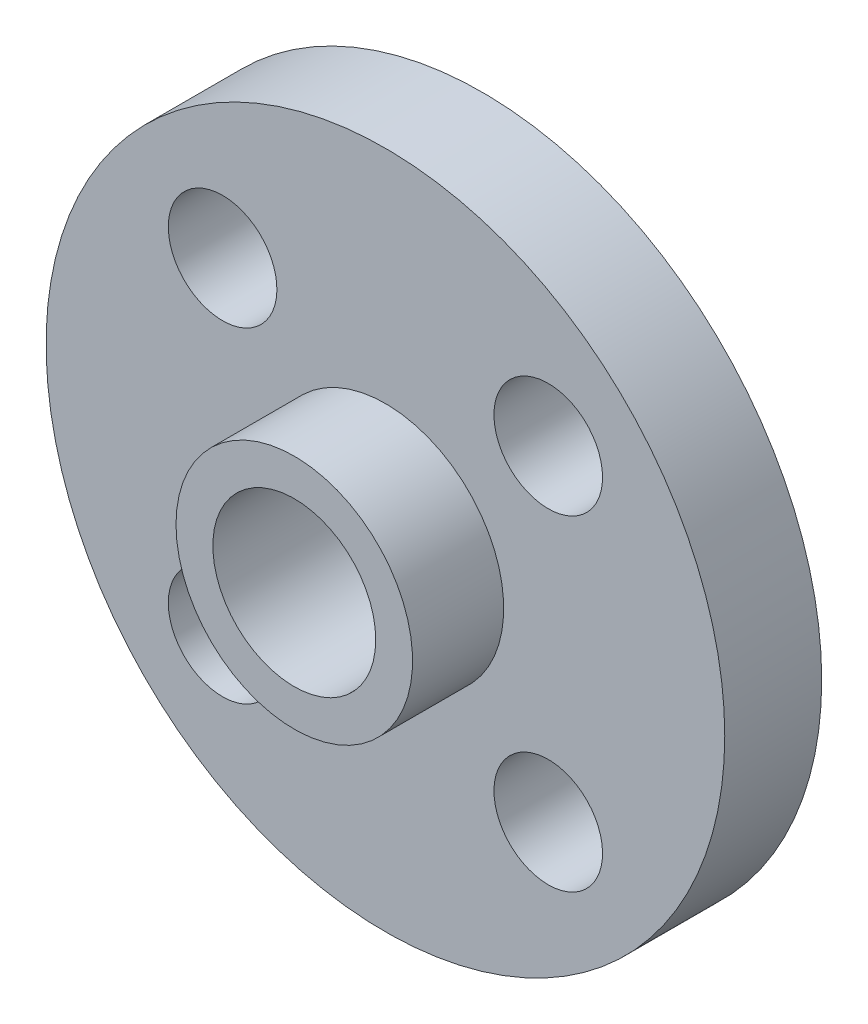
ISO-10303-21;
HEADER;
FILE_DESCRIPTION(('STEP AP214'),'2;1');
FILE_NAME('part.step','',(''),(''),'','','');
FILE_SCHEMA(('AUTOMOTIVE_DESIGN { 1 0 10303 214 1 1 1 1 }'));
ENDSEC;
DATA;
#1=APPLICATION_CONTEXT('core data for automotive mechanical design processes');
#2=APPLICATION_PROTOCOL_DEFINITION('international standard','automotive_design',2000,#1);
#3=PRODUCT_CONTEXT('',#1,'mechanical');
#4=PRODUCT('Part','Part','',(#3));
#5=PRODUCT_RELATED_PRODUCT_CATEGORY('part','',(#4));
#6=PRODUCT_DEFINITION_FORMATION('','',#4);
#7=PRODUCT_DEFINITION_CONTEXT('part definition',#1,'design');
#8=PRODUCT_DEFINITION('design','',#6,#7);
#9=PRODUCT_DEFINITION_SHAPE('','',#8);
#10=(LENGTH_UNIT() NAMED_UNIT(*) SI_UNIT(.MILLI.,.METRE.));
#11=(NAMED_UNIT(*) PLANE_ANGLE_UNIT() SI_UNIT($,.RADIAN.));
#12=(NAMED_UNIT(*) SI_UNIT($,.STERADIAN.) SOLID_ANGLE_UNIT());
#13=UNCERTAINTY_MEASURE_WITH_UNIT(LENGTH_MEASURE(1.E-05),#10,'distance_accuracy_value','');
#14=(GEOMETRIC_REPRESENTATION_CONTEXT(3) GLOBAL_UNCERTAINTY_ASSIGNED_CONTEXT((#13)) GLOBAL_UNIT_ASSIGNED_CONTEXT((#10,
#11,#12)) REPRESENTATION_CONTEXT('',''));
#15=CARTESIAN_POINT('',(0.,0.,0.));
#16=DIRECTION('',(0.,0.,1.));
#17=DIRECTION('',(1.,0.,0.));
#18=AXIS2_PLACEMENT_3D('',#15,#16,#17);
#19=CARTESIAN_POINT('',(0.,0.,0.));
#20=DIRECTION('',(0.,0.,1.));
#21=DIRECTION('',(1.,0.,0.));
#22=AXIS2_PLACEMENT_3D('',#19,#20,#21);
#23=PLANE('',#22);
#24=CARTESIAN_POINT('',(0.,0.,0.));
#25=DIRECTION('',(0.,0.,1.));
#26=DIRECTION('',(1.,0.,0.));
#27=AXIS2_PLACEMENT_3D('',#24,#25,#26);
#28=CIRCLE('',#27,44.45);
#29=CARTESIAN_POINT('',(44.45,0.,0.));
#30=VERTEX_POINT('',#29);
#31=EDGE_CURVE('E46',#30,#30,#28,.T.);
#32=ORIENTED_EDGE('',*,*,#31,.F.);
#33=EDGE_LOOP('',(#32));
#34=FACE_BOUND('',#33,.T.);
#35=CARTESIAN_POINT('',(21.3281082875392,21.3281082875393,0.));
#36=DIRECTION('',(0.,0.,1.));
#37=DIRECTION('',(1.,0.,0.));
#38=AXIS2_PLACEMENT_3D('',#35,#36,#37);
#39=CIRCLE('',#38,7.112);
#40=CARTESIAN_POINT('',(28.4401082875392,21.3281082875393,0.));
#41=VERTEX_POINT('',#40);
#42=EDGE_CURVE('E55',#41,#41,#39,.T.);
#43=ORIENTED_EDGE('',*,*,#42,.T.);
#44=EDGE_LOOP('',(#43));
#45=FACE_BOUND('',#44,.T.);
#46=CARTESIAN_POINT('',(21.3281082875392,-21.3281082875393,0.));
#47=DIRECTION('',(0.,0.,1.));
#48=DIRECTION('',(0.,-1.,0.));
#49=AXIS2_PLACEMENT_3D('',#46,#47,#48);
#50=CIRCLE('',#49,7.112);
#51=CARTESIAN_POINT('',(21.3281082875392,-28.4401082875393,0.));
#52=VERTEX_POINT('',#51);
#53=EDGE_CURVE('E68',#52,#52,#50,.T.);
#54=ORIENTED_EDGE('',*,*,#53,.T.);
#55=EDGE_LOOP('',(#54));
#56=FACE_BOUND('',#55,.T.);
#57=CARTESIAN_POINT('',(-21.3281082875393,-21.3281082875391,0.));
#58=DIRECTION('',(0.,0.,1.));
#59=DIRECTION('',(-1.,0.,0.));
#60=AXIS2_PLACEMENT_3D('',#57,#58,#59);
#61=CIRCLE('',#60,7.112);
#62=CARTESIAN_POINT('',(-28.4401082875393,-21.3281082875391,0.));
#63=VERTEX_POINT('',#62);
#64=EDGE_CURVE('E74',#63,#63,#61,.T.);
#65=ORIENTED_EDGE('',*,*,#64,.T.);
#66=EDGE_LOOP('',(#65));
#67=FACE_BOUND('',#66,.T.);
#68=CARTESIAN_POINT('',(-21.3281082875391,21.3281082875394,0.));
#69=DIRECTION('',(0.,0.,1.));
#70=DIRECTION('',(0.,1.,0.));
#71=AXIS2_PLACEMENT_3D('',#68,#69,#70);
#72=CIRCLE('',#71,7.112);
#73=CARTESIAN_POINT('',(-21.328108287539,28.4401082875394,0.));
#74=VERTEX_POINT('',#73);
#75=EDGE_CURVE('E80',#74,#74,#72,.T.);
#76=ORIENTED_EDGE('',*,*,#75,.T.);
#77=EDGE_LOOP('',(#76));
#78=FACE_BOUND('',#77,.T.);
#79=CARTESIAN_POINT('',(0.,0.,0.));
#80=DIRECTION('',(0.,0.,1.));
#81=DIRECTION('',(1.,0.,0.));
#82=AXIS2_PLACEMENT_3D('',#79,#80,#81);
#83=CIRCLE('',#82,18.034);
#84=CARTESIAN_POINT('',(18.034,0.,0.));
#85=VERTEX_POINT('',#84);
#86=EDGE_CURVE('E10',#85,#85,#83,.F.);
#87=ORIENTED_EDGE('',*,*,#86,.F.);
#88=EDGE_LOOP('',(#87));
#89=FACE_BOUND('',#88,.T.);
#90=ADVANCED_FACE('F30',(#34,#45,#56,#67,#78,#89),#23,.F.);
#91=CARTESIAN_POINT('',(0.,0.,12.7));
#92=DIRECTION('',(0.,0.,-1.));
#93=DIRECTION('',(-1.,0.,0.));
#94=AXIS2_PLACEMENT_3D('',#91,#92,#93);
#95=CYLINDRICAL_SURFACE('',#94,44.45);
#96=CARTESIAN_POINT('',(0.,0.,12.7));
#97=DIRECTION('',(0.,0.,1.));
#98=DIRECTION('',(1.,0.,0.));
#99=AXIS2_PLACEMENT_3D('',#96,#97,#98);
#100=CIRCLE('',#99,44.45);
#101=CARTESIAN_POINT('',(44.45,0.,12.7));
#102=VERTEX_POINT('',#101);
#103=EDGE_CURVE('E41',#102,#102,#100,.T.);
#104=ORIENTED_EDGE('',*,*,#103,.F.);
#105=EDGE_LOOP('',(#104));
#106=FACE_BOUND('',#105,.T.);
#107=ORIENTED_EDGE('',*,*,#31,.T.);
#108=EDGE_LOOP('',(#107));
#109=FACE_BOUND('',#108,.T.);
#110=ADVANCED_FACE('F32',(#106,#109),#95,.T.);
#111=CARTESIAN_POINT('',(0.,0.,12.7));
#112=DIRECTION('',(0.,0.,1.));
#113=DIRECTION('',(1.,0.,0.));
#114=AXIS2_PLACEMENT_3D('',#111,#112,#113);
#115=PLANE('',#114);
#116=CARTESIAN_POINT('',(-21.3281082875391,21.3281082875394,12.7));
#117=DIRECTION('',(0.,0.,1.));
#118=DIRECTION('',(0.,1.,0.));
#119=AXIS2_PLACEMENT_3D('',#116,#117,#118);
#120=CIRCLE('',#119,7.112);
#121=CARTESIAN_POINT('',(-21.328108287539,28.4401082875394,12.7));
#122=VERTEX_POINT('',#121);
#123=EDGE_CURVE('E77',#122,#122,#120,.T.);
#124=ORIENTED_EDGE('',*,*,#123,.F.);
#125=EDGE_LOOP('',(#124));
#126=FACE_BOUND('',#125,.T.);
#127=CARTESIAN_POINT('',(-21.3281082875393,-21.3281082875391,12.7));
#128=DIRECTION('',(0.,0.,1.));
#129=DIRECTION('',(-1.,0.,0.));
#130=AXIS2_PLACEMENT_3D('',#127,#128,#129);
#131=CIRCLE('',#130,7.112);
#132=CARTESIAN_POINT('',(-28.4401082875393,-21.3281082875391,12.7));
#133=VERTEX_POINT('',#132);
#134=EDGE_CURVE('E71',#133,#133,#131,.T.);
#135=ORIENTED_EDGE('',*,*,#134,.F.);
#136=EDGE_LOOP('',(#135));
#137=FACE_BOUND('',#136,.T.);
#138=CARTESIAN_POINT('',(21.3281082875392,-21.3281082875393,12.7));
#139=DIRECTION('',(0.,0.,1.));
#140=DIRECTION('',(0.,-1.,0.));
#141=AXIS2_PLACEMENT_3D('',#138,#139,#140);
#142=CIRCLE('',#141,7.112);
#143=CARTESIAN_POINT('',(21.3281082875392,-28.4401082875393,12.7));
#144=VERTEX_POINT('',#143);
#145=EDGE_CURVE('E64',#144,#144,#142,.T.);
#146=ORIENTED_EDGE('',*,*,#145,.F.);
#147=EDGE_LOOP('',(#146));
#148=FACE_BOUND('',#147,.T.);
#149=CARTESIAN_POINT('',(21.3281082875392,21.3281082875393,12.7));
#150=DIRECTION('',(0.,0.,1.));
#151=DIRECTION('',(1.,0.,0.));
#152=AXIS2_PLACEMENT_3D('',#149,#150,#151);
#153=CIRCLE('',#152,7.112);
#154=CARTESIAN_POINT('',(28.4401082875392,21.3281082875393,12.7));
#155=VERTEX_POINT('',#154);
#156=EDGE_CURVE('E59',#155,#155,#153,.T.);
#157=ORIENTED_EDGE('',*,*,#156,.F.);
#158=EDGE_LOOP('',(#157));
#159=FACE_BOUND('',#158,.T.);
#160=CARTESIAN_POINT('',(0.,0.,12.7));
#161=DIRECTION('',(0.,0.,1.));
#162=DIRECTION('',(1.,0.,0.));
#163=AXIS2_PLACEMENT_3D('',#160,#161,#162);
#164=CIRCLE('',#163,15.494);
#165=CARTESIAN_POINT('',(-15.494,0.,12.7));
#166=VERTEX_POINT('',#165);
#167=EDGE_CURVE('E37',#166,#166,#164,.T.);
#168=ORIENTED_EDGE('',*,*,#167,.F.);
#169=EDGE_LOOP('',(#168));
#170=FACE_BOUND('',#169,.T.);
#171=ORIENTED_EDGE('',*,*,#103,.T.);
#172=EDGE_LOOP('',(#171));
#173=FACE_BOUND('',#172,.T.);
#174=ADVANCED_FACE('F123',(#126,#137,#148,#159,#170,#173),#115,.T.);
#175=CARTESIAN_POINT('',(0.,0.,24.638));
#176=DIRECTION('',(0.,0.,-1.));
#177=DIRECTION('',(-1.,0.,0.));
#178=AXIS2_PLACEMENT_3D('',#175,#176,#177);
#179=CYLINDRICAL_SURFACE('',#178,15.494);
#180=CARTESIAN_POINT('',(0.,0.,24.638));
#181=DIRECTION('',(0.,0.,-1.));
#182=DIRECTION('',(-1.,0.,0.));
#183=AXIS2_PLACEMENT_3D('',#180,#181,#182);
#184=CIRCLE('',#183,15.494);
#185=CARTESIAN_POINT('',(-15.494,0.,24.638));
#186=VERTEX_POINT('',#185);
#187=EDGE_CURVE('E49',#186,#186,#184,.T.);
#188=CARTESIAN_POINT('',(-15.494,0.,12.7));
#189=CARTESIAN_POINT('',(-15.494,0.,12.8243541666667));
#190=CARTESIAN_POINT('',(-15.494,0.,12.9487083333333));
#191=CARTESIAN_POINT('',(-15.494,0.,13.1974166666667));
#192=CARTESIAN_POINT('',(-15.494,0.,13.3217708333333));
#193=CARTESIAN_POINT('',(-15.494,0.,13.5704791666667));
#194=CARTESIAN_POINT('',(-15.494,0.,13.6948333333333));
#195=CARTESIAN_POINT('',(-15.494,0.,13.9435416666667));
#196=CARTESIAN_POINT('',(-15.494,0.,14.0678958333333));
#197=CARTESIAN_POINT('',(-15.494,0.,14.3166041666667));
#198=CARTESIAN_POINT('',(-15.494,0.,14.4409583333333));
#199=CARTESIAN_POINT('',(-15.494,0.,14.6896666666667));
#200=CARTESIAN_POINT('',(-15.494,0.,14.8140208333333));
#201=CARTESIAN_POINT('',(-15.494,0.,15.0627291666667));
#202=CARTESIAN_POINT('',(-15.494,0.,15.1870833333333));
#203=CARTESIAN_POINT('',(-15.494,0.,15.4357916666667));
#204=CARTESIAN_POINT('',(-15.494,0.,15.5601458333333));
#205=CARTESIAN_POINT('',(-15.494,0.,15.8088541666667));
#206=CARTESIAN_POINT('',(-15.494,0.,15.9332083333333));
#207=CARTESIAN_POINT('',(-15.494,0.,16.1819166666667));
#208=CARTESIAN_POINT('',(-15.494,0.,16.3062708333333));
#209=CARTESIAN_POINT('',(-15.494,0.,16.5549791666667));
#210=CARTESIAN_POINT('',(-15.494,0.,16.6793333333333));
#211=CARTESIAN_POINT('',(-15.494,0.,16.9280416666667));
#212=CARTESIAN_POINT('',(-15.494,0.,17.0523958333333));
#213=CARTESIAN_POINT('',(-15.494,0.,17.3011041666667));
#214=CARTESIAN_POINT('',(-15.494,0.,17.4254583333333));
#215=CARTESIAN_POINT('',(-15.494,0.,17.6741666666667));
#216=CARTESIAN_POINT('',(-15.494,0.,17.7985208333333));
#217=CARTESIAN_POINT('',(-15.494,0.,18.0472291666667));
#218=CARTESIAN_POINT('',(-15.494,0.,18.1715833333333));
#219=CARTESIAN_POINT('',(-15.494,0.,18.4202916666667));
#220=CARTESIAN_POINT('',(-15.494,0.,18.5446458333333));
#221=CARTESIAN_POINT('',(-15.494,0.,18.7933541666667));
#222=CARTESIAN_POINT('',(-15.494,0.,18.9177083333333));
#223=CARTESIAN_POINT('',(-15.494,0.,19.1664166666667));
#224=CARTESIAN_POINT('',(-15.494,0.,19.2907708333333));
#225=CARTESIAN_POINT('',(-15.494,0.,19.5394791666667));
#226=CARTESIAN_POINT('',(-15.494,0.,19.6638333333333));
#227=CARTESIAN_POINT('',(-15.494,0.,19.9125416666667));
#228=CARTESIAN_POINT('',(-15.494,0.,20.0368958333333));
#229=CARTESIAN_POINT('',(-15.494,0.,20.2856041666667));
#230=CARTESIAN_POINT('',(-15.494,0.,20.4099583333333));
#231=CARTESIAN_POINT('',(-15.494,0.,20.6586666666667));
#232=CARTESIAN_POINT('',(-15.494,0.,20.7830208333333));
#233=CARTESIAN_POINT('',(-15.494,0.,21.0317291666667));
#234=CARTESIAN_POINT('',(-15.494,0.,21.1560833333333));
#235=CARTESIAN_POINT('',(-15.494,0.,21.4047916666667));
#236=CARTESIAN_POINT('',(-15.494,0.,21.5291458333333));
#237=CARTESIAN_POINT('',(-15.494,0.,21.7778541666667));
#238=CARTESIAN_POINT('',(-15.494,0.,21.9022083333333));
#239=CARTESIAN_POINT('',(-15.494,0.,22.1509166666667));
#240=CARTESIAN_POINT('',(-15.494,0.,22.2752708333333));
#241=CARTESIAN_POINT('',(-15.494,0.,22.5239791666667));
#242=CARTESIAN_POINT('',(-15.494,0.,22.6483333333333));
#243=CARTESIAN_POINT('',(-15.494,0.,22.8970416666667));
#244=CARTESIAN_POINT('',(-15.494,0.,23.0213958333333));
#245=CARTESIAN_POINT('',(-15.494,0.,23.2701041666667));
#246=CARTESIAN_POINT('',(-15.494,0.,23.3944583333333));
#247=CARTESIAN_POINT('',(-15.494,0.,23.6431666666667));
#248=CARTESIAN_POINT('',(-15.494,0.,23.7675208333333));
#249=CARTESIAN_POINT('',(-15.494,0.,24.0162291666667));
#250=CARTESIAN_POINT('',(-15.494,0.,24.1405833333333));
#251=CARTESIAN_POINT('',(-15.494,0.,24.3892916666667));
#252=CARTESIAN_POINT('',(-15.494,0.,24.5136458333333));
#253=CARTESIAN_POINT('',(-15.494,0.,24.638));
#254=B_SPLINE_CURVE_WITH_KNOTS('',3,(#188,#189,#190,#191,#192,#193,#194,#195,#196,#197,#198,
#199,#200,#201,#202,#203,#204,#205,#206,#207,#208,#209,#210,#211,#212,#213,#214,#215,#216,#217,
#218,#219,#220,#221,#222,#223,#224,#225,#226,#227,#228,#229,#230,#231,#232,#233,#234,#235,#236,
#237,#238,#239,#240,#241,#242,#243,#244,#245,#246,#247,#248,#249,#250,#251,#252,#253),
.UNSPECIFIED.,.F.,.F.,(4,2,2,2,2,2,2,2,2,2,2,2,2,2,2,2,2,2,2,2,2,2,2,2,2,2,2,2,2,2,2,2,4),(0.,
0.3730625,0.746125,1.1191875,1.49225,1.8653125,2.238375,2.6114375,2.9845,3.3575625,3.730625,
4.1036875,4.47675,4.8498125,5.222875,5.5959375,5.969,6.3420625,6.715125,7.0881875,7.46125,
7.8343125,8.207375,8.5804375,8.95350000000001,9.3265625,9.699625,10.0726875,10.44575,10.8188125,
11.191875,11.5649375,11.938),.UNSPECIFIED.);
#255=EDGE_CURVE('BSEAM128',#166,#186,#254,.T.);
#256=ORIENTED_EDGE('',*,*,#167,.T.);
#257=ORIENTED_EDGE('',*,*,#187,.T.);
#258=ORIENTED_EDGE('',*,*,#255,.T.);
#259=ORIENTED_EDGE('',*,*,#255,.F.);
#260=EDGE_LOOP('',(#256,#258,#257,#259));
#261=FACE_BOUND('',#260,.T.);
#262=ADVANCED_FACE('F128',(#261),#179,.T.);
#263=CARTESIAN_POINT('',(0.,0.,24.638));
#264=DIRECTION('',(0.,0.,-1.));
#265=DIRECTION('',(-1.,0.,0.));
#266=AXIS2_PLACEMENT_3D('',#263,#264,#265);
#267=PLANE('',#266);
#268=CARTESIAN_POINT('',(0.,0.,24.638));
#269=DIRECTION('',(0.,0.,1.));
#270=DIRECTION('',(1.,0.,0.));
#271=AXIS2_PLACEMENT_3D('',#268,#269,#270);
#272=CIRCLE('',#271,10.668);
#273=CARTESIAN_POINT('',(10.668,0.,24.638));
#274=VERTEX_POINT('',#273);
#275=EDGE_CURVE('E87',#274,#274,#272,.T.);
#276=ORIENTED_EDGE('',*,*,#275,.F.);
#277=EDGE_LOOP('',(#276));
#278=FACE_BOUND('',#277,.T.);
#279=ORIENTED_EDGE('',*,*,#187,.F.);
#280=EDGE_LOOP('',(#279));
#281=FACE_BOUND('',#280,.T.);
#282=ADVANCED_FACE('F132',(#278,#281),#267,.F.);
#283=CARTESIAN_POINT('',(21.3281082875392,21.3281082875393,0.));
#284=DIRECTION('',(0.,0.,1.));
#285=DIRECTION('',(1.,0.,0.));
#286=AXIS2_PLACEMENT_3D('',#283,#284,#285);
#287=CYLINDRICAL_SURFACE('',#286,7.112);
#288=ORIENTED_EDGE('',*,*,#42,.F.);
#289=EDGE_LOOP('',(#288));
#290=FACE_BOUND('',#289,.T.);
#291=ORIENTED_EDGE('',*,*,#156,.T.);
#292=EDGE_LOOP('',(#291));
#293=FACE_BOUND('',#292,.T.);
#294=ADVANCED_FACE('F135',(#290,#293),#287,.F.);
#295=CARTESIAN_POINT('',(21.3281082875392,-21.3281082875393,0.));
#296=DIRECTION('',(0.,0.,1.));
#297=DIRECTION('',(0.,-1.,0.));
#298=AXIS2_PLACEMENT_3D('',#295,#296,#297);
#299=CYLINDRICAL_SURFACE('',#298,7.112);
#300=ORIENTED_EDGE('',*,*,#53,.F.);
#301=EDGE_LOOP('',(#300));
#302=FACE_BOUND('',#301,.T.);
#303=ORIENTED_EDGE('',*,*,#145,.T.);
#304=EDGE_LOOP('',(#303));
#305=FACE_BOUND('',#304,.T.);
#306=ADVANCED_FACE('F139',(#302,#305),#299,.F.);
#307=CARTESIAN_POINT('',(-21.3281082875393,-21.3281082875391,0.));
#308=DIRECTION('',(0.,0.,1.));
#309=DIRECTION('',(-1.,0.,0.));
#310=AXIS2_PLACEMENT_3D('',#307,#308,#309);
#311=CYLINDRICAL_SURFACE('',#310,7.112);
#312=ORIENTED_EDGE('',*,*,#64,.F.);
#313=EDGE_LOOP('',(#312));
#314=FACE_BOUND('',#313,.T.);
#315=ORIENTED_EDGE('',*,*,#134,.T.);
#316=EDGE_LOOP('',(#315));
#317=FACE_BOUND('',#316,.T.);
#318=ADVANCED_FACE('F115',(#314,#317),#311,.F.);
#319=CARTESIAN_POINT('',(-21.3281082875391,21.3281082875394,0.));
#320=DIRECTION('',(0.,0.,1.));
#321=DIRECTION('',(0.,1.,0.));
#322=AXIS2_PLACEMENT_3D('',#319,#320,#321);
#323=CYLINDRICAL_SURFACE('',#322,7.112);
#324=ORIENTED_EDGE('',*,*,#75,.F.);
#325=EDGE_LOOP('',(#324));
#326=FACE_BOUND('',#325,.T.);
#327=ORIENTED_EDGE('',*,*,#123,.T.);
#328=EDGE_LOOP('',(#327));
#329=FACE_BOUND('',#328,.T.);
#330=ADVANCED_FACE('F110',(#326,#329),#323,.F.);
#331=CARTESIAN_POINT('',(0.,0.,-0.79375));
#332=DIRECTION('',(0.,0.,1.));
#333=DIRECTION('',(1.,0.,0.));
#334=AXIS2_PLACEMENT_3D('',#331,#332,#333);
#335=CYLINDRICAL_SURFACE('',#334,18.034);
#336=CARTESIAN_POINT('',(0.,0.,-0.79375));
#337=DIRECTION('',(0.,0.,-1.));
#338=DIRECTION('',(-1.,0.,0.));
#339=AXIS2_PLACEMENT_3D('',#336,#337,#338);
#340=CIRCLE('',#339,18.034);
#341=CARTESIAN_POINT('',(-18.034,0.,-0.79375));
#342=VERTEX_POINT('',#341);
#343=EDGE_CURVE('E83',#342,#342,#340,.T.);
#344=ORIENTED_EDGE('',*,*,#343,.F.);
#345=EDGE_LOOP('',(#344));
#346=FACE_BOUND('',#345,.T.);
#347=ORIENTED_EDGE('',*,*,#86,.T.);
#348=EDGE_LOOP('',(#347));
#349=FACE_BOUND('',#348,.T.);
#350=ADVANCED_FACE('F105',(#346,#349),#335,.T.);
#351=CARTESIAN_POINT('',(0.,0.,-0.79375));
#352=DIRECTION('',(0.,0.,-1.));
#353=DIRECTION('',(-1.,0.,0.));
#354=AXIS2_PLACEMENT_3D('',#351,#352,#353);
#355=PLANE('',#354);
#356=CARTESIAN_POINT('',(0.,0.,-0.79375));
#357=DIRECTION('',(0.,0.,-1.));
#358=DIRECTION('',(-1.,0.,0.));
#359=AXIS2_PLACEMENT_3D('',#356,#357,#358);
#360=CIRCLE('',#359,7.62);
#361=CARTESIAN_POINT('',(-7.62,0.,-0.79375));
#362=VERTEX_POINT('',#361);
#363=EDGE_CURVE('E90',#362,#362,#360,.T.);
#364=ORIENTED_EDGE('',*,*,#363,.F.);
#365=EDGE_LOOP('',(#364));
#366=FACE_BOUND('',#365,.T.);
#367=ORIENTED_EDGE('',*,*,#343,.T.);
#368=EDGE_LOOP('',(#367));
#369=FACE_BOUND('',#368,.T.);
#370=ADVANCED_FACE('F101',(#366,#369),#355,.T.);
#371=CARTESIAN_POINT('',(0.,0.,7.96925));
#372=DIRECTION('',(0.,0.,1.));
#373=DIRECTION('',(1.,0.,0.));
#374=AXIS2_PLACEMENT_3D('',#371,#372,#373);
#375=CYLINDRICAL_SURFACE('',#374,10.668);
#376=CARTESIAN_POINT('',(0.,0.,7.96925));
#377=DIRECTION('',(0.,0.,1.));
#378=DIRECTION('',(1.,0.,0.));
#379=AXIS2_PLACEMENT_3D('',#376,#377,#378);
#380=CIRCLE('',#379,10.668);
#381=CARTESIAN_POINT('',(10.668,0.,7.96925));
#382=VERTEX_POINT('',#381);
#383=EDGE_CURVE('E86',#382,#382,#380,.T.);
#384=ORIENTED_EDGE('',*,*,#383,.F.);
#385=EDGE_LOOP('',(#384));
#386=FACE_BOUND('',#385,.T.);
#387=ORIENTED_EDGE('',*,*,#275,.T.);
#388=EDGE_LOOP('',(#387));
#389=FACE_BOUND('',#388,.T.);
#390=ADVANCED_FACE('F104',(#386,#389),#375,.F.);
#391=CARTESIAN_POINT('',(0.,0.,7.96925));
#392=DIRECTION('',(0.,0.,1.));
#393=DIRECTION('',(1.,0.,0.));
#394=AXIS2_PLACEMENT_3D('',#391,#392,#393);
#395=PLANE('',#394);
#396=CARTESIAN_POINT('',(0.,0.,7.96925));
#397=DIRECTION('',(0.,0.,1.));
#398=DIRECTION('',(1.,0.,0.));
#399=AXIS2_PLACEMENT_3D('',#396,#397,#398);
#400=CIRCLE('',#399,7.62);
#401=CARTESIAN_POINT('',(7.62,0.,7.96925));
#402=VERTEX_POINT('',#401);
#403=EDGE_CURVE('E93',#402,#402,#400,.F.);
#404=ORIENTED_EDGE('',*,*,#403,.T.);
#405=EDGE_LOOP('',(#404));
#406=FACE_BOUND('',#405,.T.);
#407=ORIENTED_EDGE('',*,*,#383,.T.);
#408=EDGE_LOOP('',(#407));
#409=FACE_BOUND('',#408,.T.);
#410=ADVANCED_FACE('F199',(#406,#409),#395,.T.);
#411=CARTESIAN_POINT('',(0.,0.,24.639));
#412=DIRECTION('',(0.,0.,-1.));
#413=DIRECTION('',(-1.,0.,0.));
#414=AXIS2_PLACEMENT_3D('',#411,#412,#413);
#415=CYLINDRICAL_SURFACE('',#414,7.62);
#416=ORIENTED_EDGE('',*,*,#403,.F.);
#417=EDGE_LOOP('',(#416));
#418=FACE_BOUND('',#417,.T.);
#419=ORIENTED_EDGE('',*,*,#363,.T.);
#420=EDGE_LOOP('',(#419));
#421=FACE_BOUND('',#420,.T.);
#422=ADVANCED_FACE('F99',(#418,#421),#415,.F.);
#423=CLOSED_SHELL('',(#90,#110,#174,#262,#282,#294,#306,#318,#330,#350,#370,#390,#410,#422));
#424=MANIFOLD_SOLID_BREP('B2',#423);
#425=ADVANCED_BREP_SHAPE_REPRESENTATION('',(#18,#424),#14);
#426=SHAPE_DEFINITION_REPRESENTATION(#9,#425);
ENDSEC;
END-ISO-10303-21;
